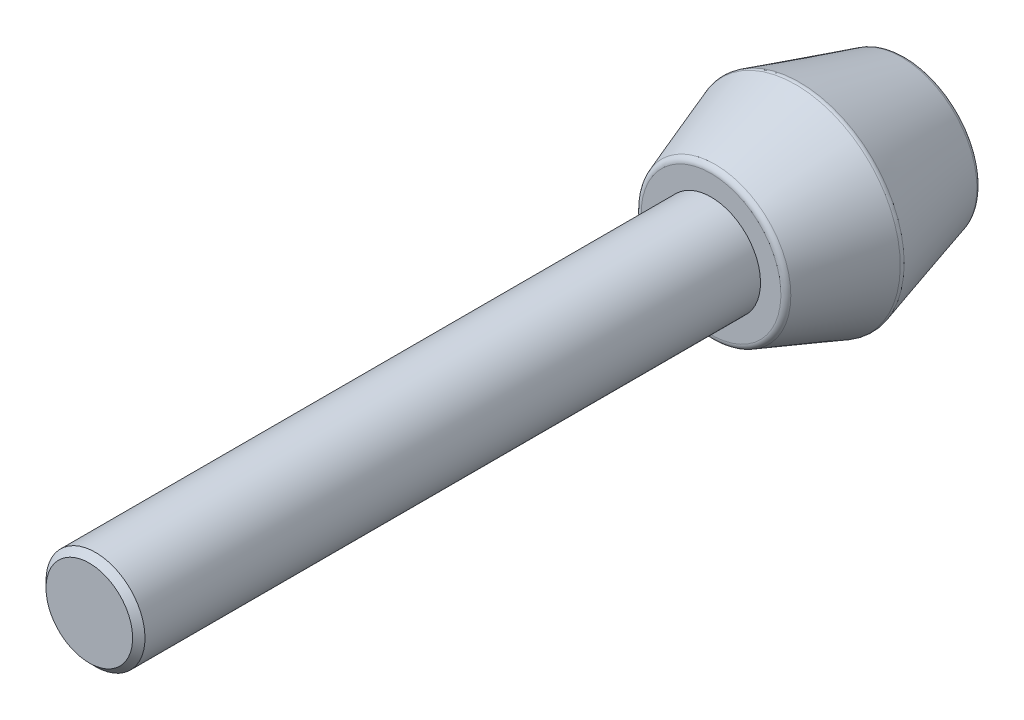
ISO-10303-21;
HEADER;
FILE_DESCRIPTION(('STEP AP214'),'2;1');
FILE_NAME('part.step','',(''),(''),'','','');
FILE_SCHEMA(('AUTOMOTIVE_DESIGN { 1 0 10303 214 1 1 1 1 }'));
ENDSEC;
DATA;
#1=APPLICATION_CONTEXT('core data for automotive mechanical design processes');
#2=APPLICATION_PROTOCOL_DEFINITION('international standard','automotive_design',2000,#1);
#3=PRODUCT_CONTEXT('',#1,'mechanical');
#4=PRODUCT('Part','Part','',(#3));
#5=PRODUCT_RELATED_PRODUCT_CATEGORY('part','',(#4));
#6=PRODUCT_DEFINITION_FORMATION('','',#4);
#7=PRODUCT_DEFINITION_CONTEXT('part definition',#1,'design');
#8=PRODUCT_DEFINITION('design','',#6,#7);
#9=PRODUCT_DEFINITION_SHAPE('','',#8);
#10=(LENGTH_UNIT() NAMED_UNIT(*) SI_UNIT(.MILLI.,.METRE.));
#11=(NAMED_UNIT(*) PLANE_ANGLE_UNIT() SI_UNIT($,.RADIAN.));
#12=(NAMED_UNIT(*) SI_UNIT($,.STERADIAN.) SOLID_ANGLE_UNIT());
#13=UNCERTAINTY_MEASURE_WITH_UNIT(LENGTH_MEASURE(1.E-05),#10,'distance_accuracy_value','');
#14=(GEOMETRIC_REPRESENTATION_CONTEXT(3) GLOBAL_UNCERTAINTY_ASSIGNED_CONTEXT((#13)) GLOBAL_UNIT_ASSIGNED_CONTEXT((#10,
#11,#12)) REPRESENTATION_CONTEXT('',''));
#15=CARTESIAN_POINT('',(0.,0.,0.));
#16=DIRECTION('',(0.,0.,1.));
#17=DIRECTION('',(1.,0.,0.));
#18=AXIS2_PLACEMENT_3D('',#15,#16,#17);
#19=CARTESIAN_POINT('',(0.,0.,0.));
#20=DIRECTION('',(0.,0.,-1.));
#21=DIRECTION('',(0.,1.,0.));
#22=AXIS2_PLACEMENT_3D('',#19,#20,#21);
#23=PLANE('',#22);
#24=CARTESIAN_POINT('',(0.,0.,0.));
#25=DIRECTION('',(0.,0.,-1.));
#26=DIRECTION('',(0.,1.,0.));
#27=AXIS2_PLACEMENT_3D('',#24,#25,#26);
#28=CIRCLE('',#27,5.62284929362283);
#29=CARTESIAN_POINT('',(0.,5.62284929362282,0.));
#30=VERTEX_POINT('',#29);
#31=EDGE_CURVE('E19',#30,#30,#28,.F.);
#32=ORIENTED_EDGE('',*,*,#31,.F.);
#33=EDGE_LOOP('',(#32));
#34=FACE_BOUND('',#33,.T.);
#35=ADVANCED_FACE('F15',(#34),#23,.T.);
#36=CARTESIAN_POINT('',(0.,0.,0.499999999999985));
#37=DIRECTION('',(0.,0.,-1.));
#38=DIRECTION('',(0.,1.,0.));
#39=AXIS2_PLACEMENT_3D('',#36,#37,#38);
#40=TOROIDAL_SURFACE('',#39,5.62284929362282,0.5);
#41=ORIENTED_EDGE('',*,*,#31,.T.);
#42=EDGE_LOOP('',(#41));
#43=FACE_BOUND('',#42,.T.);
#44=CARTESIAN_POINT('',(0.,0.,0.362639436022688));
#45=DIRECTION('',(0.,0.,1.));
#46=DIRECTION('',(0.769107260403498,-0.63911972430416,0.));
#47=AXIS2_PLACEMENT_3D('',#44,#45,#46);
#48=CIRCLE('',#47,6.10361126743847);
#49=CARTESIAN_POINT('',(4.69433174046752,-3.90093835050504,0.362639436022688));
#50=VERTEX_POINT('',#49);
#51=EDGE_CURVE('E41',#50,#50,#48,.T.);
#52=ORIENTED_EDGE('',*,*,#51,.F.);
#53=EDGE_LOOP('',(#52));
#54=FACE_BOUND('',#53,.T.);
#55=ADVANCED_FACE('F79',(#43,#54),#40,.T.);
#56=CARTESIAN_POINT('',(0.,0.,8.59564782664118));
#57=DIRECTION('',(0.,0.,1.));
#58=DIRECTION('',(0.,-1.,0.));
#59=AXIS2_PLACEMENT_3D('',#56,#57,#58);
#60=CONICAL_SURFACE('',#59,8.45589937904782,0.278299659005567);
#61=CARTESIAN_POINT('',(0.,0.,8.59564782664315));
#62=DIRECTION('',(0.,0.,1.));
#63=DIRECTION('',(1.,0.,0.));
#64=AXIS2_PLACEMENT_3D('',#61,#62,#63);
#65=CIRCLE('',#64,8.45589937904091);
#66=CARTESIAN_POINT('',(8.45589937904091,0.,8.59564782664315));
#67=VERTEX_POINT('',#66);
#68=EDGE_CURVE('E38',#67,#67,#65,.T.);
#69=ORIENTED_EDGE('',*,*,#68,.F.);
#70=EDGE_LOOP('',(#69));
#71=FACE_BOUND('',#70,.T.);
#72=ORIENTED_EDGE('',*,*,#51,.T.);
#73=EDGE_LOOP('',(#72));
#74=FACE_BOUND('',#73,.T.);
#75=ADVANCED_FACE('F76',(#71,#74),#60,.T.);
#76=CARTESIAN_POINT('',(0.,0.,8.73300839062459));
#77=DIRECTION('',(0.,0.,1.));
#78=DIRECTION('',(0.,-1.,0.));
#79=AXIS2_PLACEMENT_3D('',#76,#77,#78);
#80=TOROIDAL_SURFACE('',#79,7.97513740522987,0.499999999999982);
#81=ORIENTED_EDGE('',*,*,#68,.T.);
#82=EDGE_LOOP('',(#81));
#83=FACE_BOUND('',#82,.T.);
#84=CARTESIAN_POINT('',(0.,0.,8.90117658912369));
#85=DIRECTION('',(0.,0.,-1.));
#86=DIRECTION('',(-0.769107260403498,0.63911972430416,0.));
#87=AXIS2_PLACEMENT_3D('',#84,#85,#86);
#88=CIRCLE('',#87,8.4460083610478);
#89=CARTESIAN_POINT('',(-6.49588635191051,5.3980105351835,8.90117658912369));
#90=VERTEX_POINT('',#89);
#91=EDGE_CURVE('E35',#90,#90,#88,.F.);
#92=ORIENTED_EDGE('',*,*,#91,.F.);
#93=EDGE_LOOP('',(#92));
#94=FACE_BOUND('',#93,.T.);
#95=ADVANCED_FACE('F74',(#83,#94),#80,.T.);
#96=CARTESIAN_POINT('',(0.,0.,8.90117658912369));
#97=DIRECTION('',(0.,0.,-1.));
#98=DIRECTION('',(-1.,0.,0.));
#99=AXIS2_PLACEMENT_3D('',#96,#97,#98);
#100=CONICAL_SURFACE('',#99,8.4460083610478,0.343023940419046);
#101=ORIENTED_EDGE('',*,*,#91,.T.);
#102=EDGE_LOOP('',(#101));
#103=FACE_BOUND('',#102,.T.);
#104=CARTESIAN_POINT('',(0.,0.,15.4181681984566));
#105=DIRECTION('',(0.,0.,1.));
#106=DIRECTION('',(0.,-1.,0.));
#107=AXIS2_PLACEMENT_3D('',#104,#105,#106);
#108=CIRCLE('',#107,6.11851135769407);
#109=CARTESIAN_POINT('',(0.,-6.11851135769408,15.4181681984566));
#110=VERTEX_POINT('',#109);
#111=EDGE_CURVE('E31',#110,#110,#108,.T.);
#112=ORIENTED_EDGE('',*,*,#111,.F.);
#113=EDGE_LOOP('',(#112));
#114=FACE_BOUND('',#113,.T.);
#115=ADVANCED_FACE('F71',(#103,#114),#100,.T.);
#116=CARTESIAN_POINT('',(0.,0.,15.25));
#117=DIRECTION('',(0.,0.,-1.));
#118=DIRECTION('',(0.,1.,0.));
#119=AXIS2_PLACEMENT_3D('',#116,#117,#118);
#120=TOROIDAL_SURFACE('',#119,5.6476404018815,0.5);
#121=ORIENTED_EDGE('',*,*,#111,.T.);
#122=EDGE_LOOP('',(#121));
#123=FACE_BOUND('',#122,.T.);
#124=CARTESIAN_POINT('',(0.,0.,15.75));
#125=DIRECTION('',(0.,0.,-1.));
#126=DIRECTION('',(0.,1.,0.));
#127=AXIS2_PLACEMENT_3D('',#124,#125,#126);
#128=CIRCLE('',#127,5.6476404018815);
#129=CARTESIAN_POINT('',(0.,5.64764040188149,15.75));
#130=VERTEX_POINT('',#129);
#131=EDGE_CURVE('E34',#130,#130,#128,.T.);
#132=ORIENTED_EDGE('',*,*,#131,.T.);
#133=EDGE_LOOP('',(#132));
#134=FACE_BOUND('',#133,.T.);
#135=ADVANCED_FACE('F17',(#123,#134),#120,.T.);
#136=CARTESIAN_POINT('',(0.,0.,66.));
#137=DIRECTION('',(0.,0.,-1.));
#138=DIRECTION('',(-1.,0.,0.));
#139=AXIS2_PLACEMENT_3D('',#136,#137,#138);
#140=PLANE('',#139);
#141=CARTESIAN_POINT('',(0.,0.,66.0000000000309));
#142=DIRECTION('',(0.,0.,-1.));
#143=DIRECTION('',(-1.,0.,0.));
#144=AXIS2_PLACEMENT_3D('',#141,#142,#143);
#145=CIRCLE('',#144,3.49999999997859);
#146=CARTESIAN_POINT('',(-3.49999999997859,0.,66.0000000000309));
#147=VERTEX_POINT('',#146);
#148=EDGE_CURVE('E28',#147,#147,#145,.T.);
#149=ORIENTED_EDGE('',*,*,#148,.F.);
#150=EDGE_LOOP('',(#149));
#151=FACE_BOUND('',#150,.T.);
#152=ADVANCED_FACE('F53',(#151),#140,.F.);
#153=CARTESIAN_POINT('',(0.,0.,15.75));
#154=DIRECTION('',(0.,0.,-1.));
#155=DIRECTION('',(0.,1.,0.));
#156=AXIS2_PLACEMENT_3D('',#153,#154,#155);
#157=PLANE('',#156);
#158=ORIENTED_EDGE('',*,*,#131,.F.);
#159=EDGE_LOOP('',(#158));
#160=FACE_BOUND('',#159,.T.);
#161=CARTESIAN_POINT('',(0.,0.,15.75));
#162=DIRECTION('',(0.,0.,1.));
#163=DIRECTION('',(0.,-1.,0.));
#164=AXIS2_PLACEMENT_3D('',#161,#162,#163);
#165=CIRCLE('',#164,4.);
#166=CARTESIAN_POINT('',(0.,-4.00000000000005,15.75));
#167=VERTEX_POINT('',#166);
#168=EDGE_CURVE('E23',#167,#167,#165,.T.);
#169=ORIENTED_EDGE('',*,*,#168,.F.);
#170=EDGE_LOOP('',(#169));
#171=FACE_BOUND('',#170,.T.);
#172=ADVANCED_FACE('F49',(#160,#171),#157,.F.);
#173=CARTESIAN_POINT('',(0.,0.,65.4999999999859));
#174=DIRECTION('',(0.,0.,-1.));
#175=DIRECTION('',(-1.,0.,0.));
#176=AXIS2_PLACEMENT_3D('',#173,#174,#175);
#177=CONICAL_SURFACE('',#176,3.999999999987,0.785398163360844);
#178=CARTESIAN_POINT('',(0.,0.,65.5));
#179=DIRECTION('',(0.,0.,1.));
#180=DIRECTION('',(0.,-1.,0.));
#181=AXIS2_PLACEMENT_3D('',#178,#179,#180);
#182=CIRCLE('',#181,4.);
#183=CARTESIAN_POINT('',(0.,-4.00000000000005,65.5));
#184=VERTEX_POINT('',#183);
#185=EDGE_CURVE('E10',#184,#184,#182,.F.);
#186=ORIENTED_EDGE('',*,*,#185,.F.);
#187=EDGE_LOOP('',(#186));
#188=FACE_BOUND('',#187,.T.);
#189=ORIENTED_EDGE('',*,*,#148,.T.);
#190=EDGE_LOOP('',(#189));
#191=FACE_BOUND('',#190,.T.);
#192=ADVANCED_FACE('F52',(#188,#191),#177,.T.);
#193=CARTESIAN_POINT('',(0.,0.,2.75));
#194=DIRECTION('',(0.,0.,1.));
#195=DIRECTION('',(0.,-1.,0.));
#196=AXIS2_PLACEMENT_3D('',#193,#194,#195);
#197=CYLINDRICAL_SURFACE('',#196,4.);
#198=ORIENTED_EDGE('',*,*,#185,.T.);
#199=EDGE_LOOP('',(#198));
#200=FACE_BOUND('',#199,.T.);
#201=ORIENTED_EDGE('',*,*,#168,.T.);
#202=EDGE_LOOP('',(#201));
#203=FACE_BOUND('',#202,.T.);
#204=ADVANCED_FACE('F57',(#200,#203),#197,.T.);
#205=CLOSED_SHELL('',(#35,#55,#75,#95,#115,#135,#152,#172,#192,#204));
#206=MANIFOLD_SOLID_BREP('B1',#205);
#207=ADVANCED_BREP_SHAPE_REPRESENTATION('',(#18,#206),#14);
#208=SHAPE_DEFINITION_REPRESENTATION(#9,#207);
ENDSEC;
END-ISO-10303-21;
